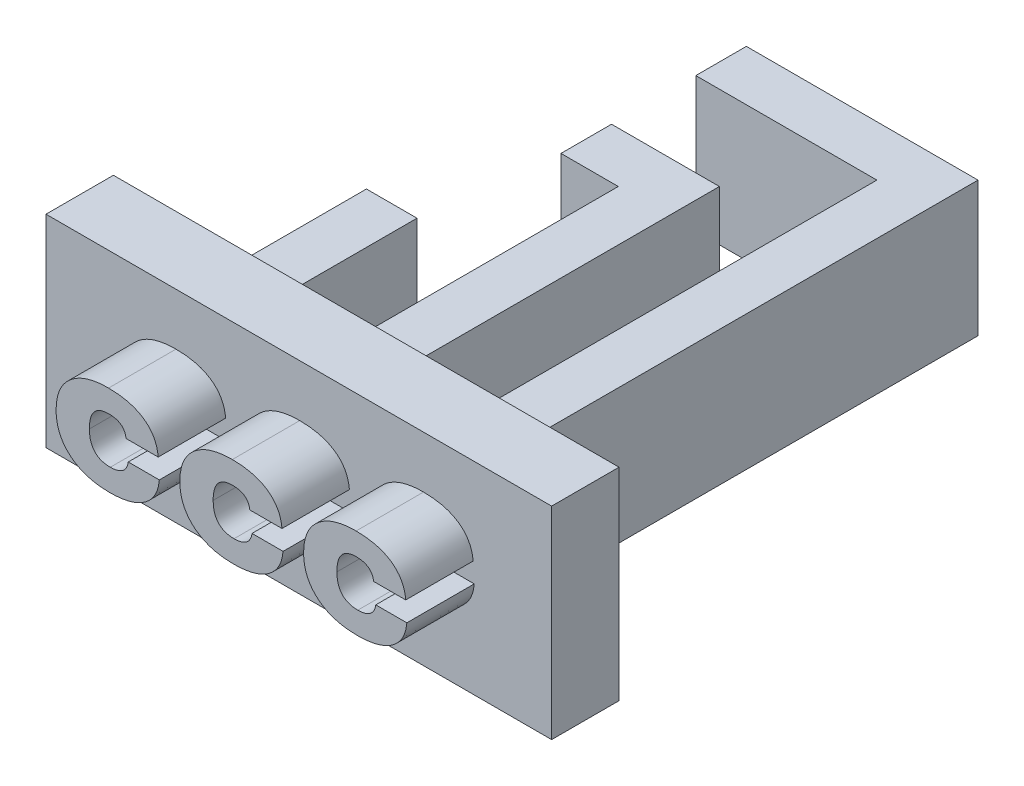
from build123d import *

# Parameters (mm, degrees)
SKETCH1_W           = 15
SKETCH1_H           = 6
BOSS_EXTRUDE1_DEPTH = 2
BOSS_EXTRUDE2_DEPTH = 2
SKETCH3_W           = 1.5
SKETCH3_H           = 4.4
BOSS_EXTRUDE3_DEPTH = 2


with BuildPart() as part:
    # Sketch1 → Boss-Extrude1 (new body)
    with BuildSketch(Plane.XY):
        Rectangle(SKETCH1_W, SKETCH1_H)
    extrude(amount=BOSS_EXTRUDE1_DEPTH)

    # Sketch2 → Boss-Extrude2 (add)
    with BuildSketch(Plane.XY.offset(2)):
        with BuildLine():
            Line((-3.060082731, -0.145888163), (-2.138122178, -0.145888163))
            add(Edge.make_bspline(
                [(-2.138122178, -0.145888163), (-2.142670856, -0.186817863), (-2.151591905, -0.267090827), (-2.177769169, -0.383345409), (-2.21581097, -0.492138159), (-2.263624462, -0.594453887), (-2.323094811, -0.689286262), (-2.393268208, -0.777226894), (-2.474496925, -0.857513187), (-2.56593251, -0.930702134), (-2.666921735, -0.996049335), (-2.776982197, -1.052595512), (-2.895454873, -1.100578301), (-3.022533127, -1.139544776), (-3.158112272, -1.169766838), (-3.302219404, -1.190920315), (-3.454592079, -1.204838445), (-3.559102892, -1.206109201), (-3.612641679, -1.206760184)],
                knots=[0, 0, 0, 0, 0.976829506, 1.915797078, 2.820653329, 3.707285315, 4.590388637, 5.470720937, 6.371504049, 7.295059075, 8.245589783, 9.221265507, 10.22720936, 11.275107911, 12.372107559, 13.52041678, 14.729759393, 16, 16, 16, 16], degree=3))
            add(Edge.make_bspline(
                [(-3.612641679, -1.206760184), (-3.672703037, -1.205681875), (-3.78980194, -1.203579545), (-3.960409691, -1.187028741), (-4.121131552, -1.159524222), (-4.272151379, -1.120467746), (-4.41338954, -1.070117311), (-4.545018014, -1.008999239), (-4.666052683, -0.9357143), (-4.759428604, -0.866298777), (-4.827861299, -0.80519677), (-4.876126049, -0.757629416), (-4.920907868, -0.707879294), (-4.961799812, -0.655502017), (-5.001017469, -0.602324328), (-5.03520084, -0.545835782), (-5.066531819, -0.487757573), (-5.095227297, -0.427867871), (-5.119706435, -0.365492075), (-5.141169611, -0.301230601), (-5.160246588, -0.235142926), (-5.173972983, -0.16652574), (-5.186283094, -0.096102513), (-5.194098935, -0.023574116), (-5.199662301, 0.050901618), (-5.200117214, 0.101226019), (-5.200348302, 0.126789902)],
                knots=[0, 0, 0, 0, 1.844349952, 3.595845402, 5.258382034, 6.847576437, 8.380255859, 9.857610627, 11.296535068, 12.718617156, 13.423703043, 14.112710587, 14.79899505, 15.477617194, 16.152961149, 16.826845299, 17.503194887, 18.179359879, 18.864977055, 19.559518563, 20.259847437, 20.975709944, 21.707382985, 22.454791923, 23.215062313, 24, 24, 24, 24], degree=3))
            add(Edge.make_bspline(
                [(-5.200348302, 0.126789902), (-5.20010237, 0.152180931), (-5.199614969, 0.202502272), (-5.194209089, 0.276824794), (-5.186092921, 0.349110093), (-5.174639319, 0.419303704), (-5.16060764, 0.487612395), (-5.142177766, 0.553751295), (-5.121526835, 0.618038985), (-5.096362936, 0.679989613), (-5.06892589, 0.74011142), (-5.037645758, 0.797974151), (-5.003916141, 0.854253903), (-4.966122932, 0.908133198), (-4.925686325, 0.960385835), (-4.880950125, 1.009688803), (-4.833769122, 1.057627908), (-4.766340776, 1.11879755), (-4.675008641, 1.189066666), (-4.555365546, 1.261581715), (-4.426723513, 1.323905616), (-4.288155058, 1.373282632), (-4.140527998, 1.412584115), (-3.983451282, 1.440688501), (-3.816730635, 1.457118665), (-3.702542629, 1.459248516), (-3.644025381, 1.460339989)],
                knots=[0, 0, 0, 0, 0.788949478, 1.563583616, 2.314590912, 3.048845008, 3.773225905, 4.480463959, 5.181590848, 5.870415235, 6.557195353, 7.234374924, 7.913502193, 8.595071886, 9.278472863, 9.965397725, 10.662604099, 11.368153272, 12.793402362, 14.235777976, 15.708930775, 17.227954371, 18.799982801, 20.451742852, 22.181645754, 24, 24, 24, 24], degree=3))
            add(Edge.make_bspline(
                [(-3.644025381, 1.460339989), (-3.590145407, 1.459654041), (-3.484967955, 1.458315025), (-3.331779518, 1.444898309), (-3.187282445, 1.425014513), (-3.051742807, 1.395613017), (-2.925065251, 1.357757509), (-2.807100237, 1.311399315), (-2.697988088, 1.256802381), (-2.597921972, 1.19407992), (-2.507288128, 1.123496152), (-2.42730916, 1.045048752), (-2.357479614, 0.959432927), (-2.298872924, 0.866301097), (-2.249803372, 0.766268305), (-2.212782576, 0.658660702), (-2.184664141, 0.544165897), (-2.175657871, 0.464783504), (-2.17104934, 0.42416334)],
                knots=[0, 0, 0, 0, 1.289638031, 2.517463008, 3.678757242, 4.779638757, 5.834372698, 6.840786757, 7.810284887, 8.751219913, 9.663723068, 10.555058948, 11.427779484, 12.302574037, 13.183982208, 14.089056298, 15.022165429, 16, 16, 16, 16], degree=3))
            Line((-2.17104934, 0.42416334), (-3.125937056, 0.42416334))
            add(Edge.make_bspline(
                [(-3.125937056, 0.42416334), (-3.127887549, 0.43930189), (-3.131710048, 0.468969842), (-3.142040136, 0.511730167), (-3.155998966, 0.551467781), (-3.173017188, 0.588472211), (-3.193630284, 0.622418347), (-3.217560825, 0.653683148), (-3.244880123, 0.682137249), (-3.275932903, 0.70732909), (-3.310313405, 0.72961548), (-3.347848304, 0.749134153), (-3.388701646, 0.76557697), (-3.432765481, 0.77899212), (-3.480105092, 0.789183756), (-3.530681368, 0.796119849), (-3.584421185, 0.801027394), (-3.621376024, 0.801535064), (-3.640423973, 0.801796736)],
                knots=[0, 0, 0, 0, 1.02792653, 2.014490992, 2.957386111, 3.862121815, 4.753924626, 5.627574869, 6.51019678, 7.405362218, 8.315615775, 9.266619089, 10.251558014, 11.278704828, 12.366648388, 13.51059177, 14.716862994, 16, 16, 16, 16], degree=3))
            add(Edge.make_bspline(
                [(-3.640423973, 0.801796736), (-3.66359615, 0.801322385), (-3.708533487, 0.800402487), (-3.773695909, 0.792761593), (-3.834173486, 0.779391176), (-3.890254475, 0.760839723), (-3.942034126, 0.737056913), (-3.989624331, 0.708404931), (-4.032399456, 0.67383737), (-4.070628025, 0.634091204), (-4.104105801, 0.588767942), (-4.133882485, 0.538692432), (-4.157647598, 0.482571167), (-4.177808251, 0.421494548), (-4.193663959, 0.355071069), (-4.204784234, 0.283334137), (-4.211575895, 0.206324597), (-4.212207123, 0.153214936), (-4.212533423, 0.125760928)],
                knots=[0, 0, 0, 0, 1.096253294, 2.125941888, 3.09853747, 4.02234602, 4.9155674, 5.789561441, 6.643741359, 7.510358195, 8.391630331, 9.304611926, 10.260406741, 11.268901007, 12.345516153, 13.487518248, 14.70122137, 16, 16, 16, 16], degree=3))
            add(Edge.make_bspline(
                [(-4.212533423, 0.125760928), (-4.212023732, 0.098820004), (-4.211034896, 0.046552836), (-4.20387538, -0.029304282), (-4.191745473, -0.100083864), (-4.174082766, -0.165772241), (-4.152269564, -0.226559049), (-4.125261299, -0.282308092), (-4.09338658, -0.333065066), (-4.056054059, -0.378504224), (-4.014296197, -0.419012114), (-3.96742428, -0.453622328), (-3.91626571, -0.483220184), (-3.860158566, -0.506780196), (-3.799647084, -0.525328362), (-3.73468148, -0.538434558), (-3.665177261, -0.547030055), (-3.617299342, -0.547812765), (-3.592576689, -0.548216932)],
                knots=[0, 0, 0, 0, 1.234472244, 2.394957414, 3.488022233, 4.52125041, 5.508253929, 6.443198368, 7.354559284, 8.248126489, 9.131859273, 10.013633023, 10.911406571, 11.833948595, 12.795981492, 13.807064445, 14.867636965, 16, 16, 16, 16], degree=3))
            add(Edge.make_bspline(
                [(-3.592576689, -0.548216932), (-3.573523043, -0.548008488), (-3.53637073, -0.547602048), (-3.482331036, -0.541902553), (-3.431051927, -0.534930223), (-3.383278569, -0.522562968), (-3.338007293, -0.508440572), (-3.295951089, -0.490511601), (-3.256998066, -0.469088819), (-3.220875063, -0.445176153), (-3.188314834, -0.417525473), (-3.158686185, -0.387396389), (-3.133666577, -0.353410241), (-3.111160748, -0.317572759), (-3.093383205, -0.278451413), (-3.078216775, -0.23709906), (-3.066824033, -0.192623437), (-3.06236613, -0.161718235), (-3.060082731, -0.145888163)],
                knots=[0, 0, 0, 0, 1.233312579, 2.404810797, 3.516940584, 4.580999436, 5.596108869, 6.586365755, 7.535726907, 8.472201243, 9.38661427, 10.29778373, 11.201885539, 12.11434029, 13.033597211, 13.978725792, 14.964675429, 16, 16, 16, 16], degree=3))
        make_face()
        with BuildLine():
            Line((0.611295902, -0.145888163), (1.533256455, -0.145888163))
            add(Edge.make_bspline(
                [(1.533256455, -0.145888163), (1.528707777, -0.186817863), (1.519786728, -0.267090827), (1.493609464, -0.383345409), (1.455567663, -0.492138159), (1.407754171, -0.594453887), (1.348283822, -0.689286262), (1.278110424, -0.777226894), (1.196881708, -0.857513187), (1.105446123, -0.930702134), (1.004456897, -0.996049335), (0.894396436, -1.052595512), (0.775923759, -1.100578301), (0.648845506, -1.139544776), (0.51326636, -1.169766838), (0.369159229, -1.190920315), (0.216786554, -1.204838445), (0.112275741, -1.206109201), (0.058736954, -1.206760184)],
                knots=[0, 0, 0, 0, 0.976829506, 1.915797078, 2.820653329, 3.707285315, 4.590388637, 5.470720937, 6.371504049, 7.295059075, 8.245589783, 9.221265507, 10.22720936, 11.275107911, 12.372107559, 13.52041678, 14.729759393, 16, 16, 16, 16], degree=3))
            add(Edge.make_bspline(
                [(0.058736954, -1.206760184), (-0.001324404, -1.205681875), (-0.118423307, -1.203579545), (-0.289031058, -1.187028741), (-0.449752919, -1.159524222), (-0.600772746, -1.120467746), (-0.742010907, -1.070117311), (-0.873639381, -1.008999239), (-0.99467405, -0.9357143), (-1.088049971, -0.866298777), (-1.156482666, -0.80519677), (-1.204747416, -0.757629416), (-1.249529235, -0.707879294), (-1.290421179, -0.655502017), (-1.329638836, -0.602324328), (-1.363822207, -0.545835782), (-1.395153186, -0.487757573), (-1.423848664, -0.427867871), (-1.448327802, -0.365492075), (-1.469790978, -0.301230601), (-1.488867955, -0.235142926), (-1.50259435, -0.16652574), (-1.514904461, -0.096102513), (-1.522720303, -0.023574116), (-1.528283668, 0.050901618), (-1.528738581, 0.101226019), (-1.528969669, 0.126789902)],
                knots=[0, 0, 0, 0, 1.844349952, 3.595845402, 5.258382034, 6.847576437, 8.380255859, 9.857610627, 11.296535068, 12.718617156, 13.423703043, 14.112710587, 14.79899505, 15.477617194, 16.152961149, 16.826845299, 17.503194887, 18.179359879, 18.864977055, 19.559518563, 20.259847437, 20.975709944, 21.707382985, 22.454791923, 23.215062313, 24, 24, 24, 24], degree=3))
            add(Edge.make_bspline(
                [(-1.528969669, 0.126789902), (-1.528723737, 0.152180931), (-1.528236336, 0.202502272), (-1.522830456, 0.276824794), (-1.514714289, 0.349110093), (-1.503260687, 0.419303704), (-1.489229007, 0.487612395), (-1.470799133, 0.553751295), (-1.450148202, 0.618038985), (-1.424984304, 0.679989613), (-1.397547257, 0.74011142), (-1.366267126, 0.797974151), (-1.332537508, 0.854253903), (-1.294744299, 0.908133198), (-1.254307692, 0.960385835), (-1.209571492, 1.009688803), (-1.162390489, 1.057627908), (-1.094962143, 1.11879755), (-1.003630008, 1.189066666), (-0.883986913, 1.261581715), (-0.75534488, 1.323905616), (-0.616776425, 1.373282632), (-0.469149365, 1.412584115), (-0.312072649, 1.440688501), (-0.145352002, 1.457118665), (-0.031163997, 1.459248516), (0.027353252, 1.460339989)],
                knots=[0, 0, 0, 0, 0.788949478, 1.563583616, 2.314590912, 3.048845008, 3.773225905, 4.480463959, 5.181590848, 5.870415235, 6.557195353, 7.234374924, 7.913502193, 8.595071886, 9.278472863, 9.965397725, 10.662604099, 11.368153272, 12.793402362, 14.235777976, 15.708930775, 17.227954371, 18.799982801, 20.451742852, 22.181645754, 24, 24, 24, 24], degree=3))
            add(Edge.make_bspline(
                [(0.027353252, 1.460339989), (0.081233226, 1.459654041), (0.186410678, 1.458315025), (0.339599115, 1.444898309), (0.484096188, 1.425014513), (0.619635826, 1.395613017), (0.746313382, 1.357757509), (0.864278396, 1.311399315), (0.973390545, 1.256802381), (1.073456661, 1.19407992), (1.164090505, 1.123496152), (1.244069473, 1.045048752), (1.313899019, 0.959432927), (1.372505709, 0.866301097), (1.421575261, 0.766268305), (1.458596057, 0.658660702), (1.486714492, 0.544165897), (1.495720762, 0.464783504), (1.500329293, 0.42416334)],
                knots=[0, 0, 0, 0, 1.289638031, 2.517463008, 3.678757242, 4.779638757, 5.834372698, 6.840786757, 7.810284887, 8.751219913, 9.663723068, 10.555058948, 11.427779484, 12.302574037, 13.183982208, 14.089056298, 15.022165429, 16, 16, 16, 16], degree=3))
            Line((1.500329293, 0.42416334), (0.545441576, 0.42416334))
            add(Edge.make_bspline(
                [(0.545441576, 0.42416334), (0.543491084, 0.43930189), (0.539668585, 0.468969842), (0.529338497, 0.511730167), (0.515379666, 0.551467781), (0.498361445, 0.588472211), (0.477748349, 0.622418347), (0.453817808, 0.653683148), (0.42649851, 0.682137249), (0.39544573, 0.70732909), (0.361065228, 0.72961548), (0.323530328, 0.749134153), (0.282676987, 0.76557697), (0.238613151, 0.77899212), (0.191273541, 0.789183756), (0.140697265, 0.796119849), (0.086957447, 0.801027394), (0.050002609, 0.801535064), (0.03095466, 0.801796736)],
                knots=[0, 0, 0, 0, 1.02792653, 2.014490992, 2.957386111, 3.862121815, 4.753924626, 5.627574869, 6.51019678, 7.405362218, 8.315615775, 9.266619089, 10.251558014, 11.278704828, 12.366648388, 13.51059177, 14.716862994, 16, 16, 16, 16], degree=3))
            add(Edge.make_bspline(
                [(0.03095466, 0.801796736), (0.007782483, 0.801322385), (-0.037154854, 0.800402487), (-0.102317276, 0.792761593), (-0.162794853, 0.779391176), (-0.218875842, 0.760839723), (-0.270655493, 0.737056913), (-0.318245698, 0.708404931), (-0.361020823, 0.67383737), (-0.399249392, 0.634091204), (-0.432727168, 0.588767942), (-0.462503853, 0.538692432), (-0.486268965, 0.482571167), (-0.506429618, 0.421494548), (-0.522285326, 0.355071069), (-0.533405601, 0.283334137), (-0.540197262, 0.206324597), (-0.54082849, 0.153214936), (-0.54115479, 0.125760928)],
                knots=[0, 0, 0, 0, 1.096253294, 2.125941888, 3.09853747, 4.02234602, 4.9155674, 5.789561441, 6.643741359, 7.510358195, 8.391630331, 9.304611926, 10.260406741, 11.268901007, 12.345516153, 13.487518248, 14.70122137, 16, 16, 16, 16], degree=3))
            add(Edge.make_bspline(
                [(-0.54115479, 0.125760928), (-0.540645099, 0.098820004), (-0.539656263, 0.046552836), (-0.532496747, -0.029304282), (-0.52036684, -0.100083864), (-0.502704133, -0.165772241), (-0.480890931, -0.226559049), (-0.453882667, -0.282308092), (-0.422007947, -0.333065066), (-0.384675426, -0.378504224), (-0.342917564, -0.419012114), (-0.296045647, -0.453622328), (-0.244887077, -0.483220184), (-0.188779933, -0.506780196), (-0.128268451, -0.525328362), (-0.063302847, -0.538434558), (0.006201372, -0.547030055), (0.054079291, -0.547812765), (0.078801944, -0.548216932)],
                knots=[0, 0, 0, 0, 1.234472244, 2.394957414, 3.488022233, 4.52125041, 5.508253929, 6.443198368, 7.354559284, 8.248126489, 9.131859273, 10.013633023, 10.911406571, 11.833948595, 12.795981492, 13.807064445, 14.867636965, 16, 16, 16, 16], degree=3))
            add(Edge.make_bspline(
                [(0.078801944, -0.548216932), (0.09785559, -0.548008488), (0.135007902, -0.547602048), (0.189047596, -0.541902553), (0.240326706, -0.534930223), (0.288100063, -0.522562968), (0.33337134, -0.508440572), (0.375427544, -0.490511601), (0.414380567, -0.469088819), (0.45050357, -0.445176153), (0.483063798, -0.417525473), (0.512692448, -0.387396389), (0.537712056, -0.353410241), (0.560217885, -0.317572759), (0.577995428, -0.278451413), (0.593161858, -0.23709906), (0.6045546, -0.192623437), (0.609012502, -0.161718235), (0.611295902, -0.145888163)],
                knots=[0, 0, 0, 0, 1.233312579, 2.404810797, 3.516940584, 4.580999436, 5.596108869, 6.586365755, 7.535726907, 8.472201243, 9.38661427, 10.29778373, 11.201885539, 12.11434029, 13.033597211, 13.978725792, 14.964675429, 16, 16, 16, 16], degree=3))
        make_face()
        with BuildLine():
            Line((4.282674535, -0.145888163), (5.204635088, -0.145888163))
            add(Edge.make_bspline(
                [(5.204635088, -0.145888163), (5.20008641, -0.186817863), (5.191165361, -0.267090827), (5.164988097, -0.383345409), (5.126946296, -0.492138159), (5.079132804, -0.594453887), (5.019662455, -0.689286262), (4.949489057, -0.777226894), (4.868260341, -0.857513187), (4.776824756, -0.930702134), (4.67583553, -0.996049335), (4.565775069, -1.052595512), (4.447302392, -1.100578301), (4.320224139, -1.139544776), (4.184644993, -1.169766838), (4.040537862, -1.190920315), (3.888165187, -1.204838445), (3.783654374, -1.206109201), (3.730115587, -1.206760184)],
                knots=[0, 0, 0, 0, 0.976829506, 1.915797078, 2.820653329, 3.707285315, 4.590388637, 5.470720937, 6.371504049, 7.295059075, 8.245589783, 9.221265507, 10.22720936, 11.275107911, 12.372107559, 13.52041678, 14.729759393, 16, 16, 16, 16], degree=3))
            add(Edge.make_bspline(
                [(3.730115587, -1.206760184), (3.670054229, -1.205681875), (3.552955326, -1.203579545), (3.382347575, -1.187028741), (3.221625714, -1.159524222), (3.070605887, -1.120467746), (2.929367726, -1.070117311), (2.797739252, -1.008999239), (2.676704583, -0.9357143), (2.583328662, -0.866298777), (2.514895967, -0.80519677), (2.466631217, -0.757629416), (2.421849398, -0.707879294), (2.380957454, -0.655502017), (2.341739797, -0.602324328), (2.307556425, -0.545835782), (2.276225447, -0.487757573), (2.247529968, -0.427867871), (2.223050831, -0.365492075), (2.201587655, -0.301230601), (2.182510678, -0.235142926), (2.168784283, -0.16652574), (2.156474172, -0.096102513), (2.14865833, -0.023574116), (2.143094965, 0.050901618), (2.142640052, 0.101226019), (2.142408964, 0.126789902)],
                knots=[0, 0, 0, 0, 1.844349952, 3.595845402, 5.258382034, 6.847576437, 8.380255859, 9.857610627, 11.296535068, 12.718617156, 13.423703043, 14.112710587, 14.79899505, 15.477617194, 16.152961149, 16.826845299, 17.503194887, 18.179359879, 18.864977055, 19.559518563, 20.259847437, 20.975709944, 21.707382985, 22.454791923, 23.215062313, 24, 24, 24, 24], degree=3))
            add(Edge.make_bspline(
                [(2.142408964, 0.126789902), (2.142654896, 0.152180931), (2.143142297, 0.202502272), (2.148548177, 0.276824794), (2.156664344, 0.349110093), (2.168117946, 0.419303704), (2.182149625, 0.487612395), (2.2005795, 0.553751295), (2.221230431, 0.618038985), (2.246394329, 0.679989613), (2.273831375, 0.74011142), (2.305111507, 0.797974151), (2.338841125, 0.854253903), (2.376634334, 0.908133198), (2.417070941, 0.960385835), (2.461807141, 1.009688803), (2.508988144, 1.057627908), (2.57641649, 1.11879755), (2.667748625, 1.189066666), (2.78739172, 1.261581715), (2.916033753, 1.323905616), (3.054602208, 1.373282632), (3.202229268, 1.412584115), (3.359305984, 1.440688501), (3.52602663, 1.457118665), (3.640214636, 1.459248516), (3.698731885, 1.460339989)],
                knots=[0, 0, 0, 0, 0.788949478, 1.563583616, 2.314590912, 3.048845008, 3.773225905, 4.480463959, 5.181590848, 5.870415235, 6.557195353, 7.234374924, 7.913502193, 8.595071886, 9.278472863, 9.965397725, 10.662604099, 11.368153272, 12.793402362, 14.235777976, 15.708930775, 17.227954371, 18.799982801, 20.451742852, 22.181645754, 24, 24, 24, 24], degree=3))
            add(Edge.make_bspline(
                [(3.698731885, 1.460339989), (3.752611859, 1.459654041), (3.857789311, 1.458315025), (4.010977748, 1.444898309), (4.155474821, 1.425014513), (4.291014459, 1.395613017), (4.417692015, 1.357757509), (4.535657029, 1.311399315), (4.644769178, 1.256802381), (4.744835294, 1.19407992), (4.835469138, 1.123496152), (4.915448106, 1.045048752), (4.985277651, 0.959432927), (5.043884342, 0.866301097), (5.092953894, 0.766268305), (5.12997469, 0.658660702), (5.158093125, 0.544165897), (5.167099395, 0.464783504), (5.171707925, 0.42416334)],
                knots=[0, 0, 0, 0, 1.289638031, 2.517463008, 3.678757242, 4.779638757, 5.834372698, 6.840786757, 7.810284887, 8.751219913, 9.663723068, 10.555058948, 11.427779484, 12.302574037, 13.183982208, 14.089056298, 15.022165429, 16, 16, 16, 16], degree=3))
            Line((5.171707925, 0.42416334), (4.216820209, 0.42416334))
            add(Edge.make_bspline(
                [(4.216820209, 0.42416334), (4.214869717, 0.43930189), (4.211047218, 0.468969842), (4.20071713, 0.511730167), (4.186758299, 0.551467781), (4.169740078, 0.588472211), (4.149126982, 0.622418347), (4.125196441, 0.653683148), (4.097877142, 0.682137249), (4.066824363, 0.70732909), (4.032443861, 0.72961548), (3.994908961, 0.749134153), (3.95405562, 0.76557697), (3.909991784, 0.77899212), (3.862652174, 0.789183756), (3.812075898, 0.796119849), (3.75833608, 0.801027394), (3.721381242, 0.801535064), (3.702333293, 0.801796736)],
                knots=[0, 0, 0, 0, 1.02792653, 2.014490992, 2.957386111, 3.862121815, 4.753924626, 5.627574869, 6.51019678, 7.405362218, 8.315615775, 9.266619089, 10.251558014, 11.278704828, 12.366648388, 13.51059177, 14.716862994, 16, 16, 16, 16], degree=3))
            add(Edge.make_bspline(
                [(3.702333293, 0.801796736), (3.679161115, 0.801322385), (3.634223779, 0.800402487), (3.569061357, 0.792761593), (3.50858378, 0.779391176), (3.452502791, 0.760839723), (3.400723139, 0.737056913), (3.353132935, 0.708404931), (3.31035781, 0.67383737), (3.272129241, 0.634091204), (3.238651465, 0.588767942), (3.20887478, 0.538692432), (3.185109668, 0.482571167), (3.164949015, 0.421494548), (3.149093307, 0.355071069), (3.137973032, 0.283334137), (3.13118137, 0.206324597), (3.130550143, 0.153214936), (3.130223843, 0.125760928)],
                knots=[0, 0, 0, 0, 1.096253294, 2.125941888, 3.09853747, 4.02234602, 4.9155674, 5.789561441, 6.643741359, 7.510358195, 8.391630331, 9.304611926, 10.260406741, 11.268901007, 12.345516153, 13.487518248, 14.70122137, 16, 16, 16, 16], degree=3))
            add(Edge.make_bspline(
                [(3.130223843, 0.125760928), (3.130733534, 0.098820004), (3.131722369, 0.046552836), (3.138881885, -0.029304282), (3.151011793, -0.100083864), (3.1686745, -0.165772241), (3.190487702, -0.226559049), (3.217495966, -0.282308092), (3.249370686, -0.333065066), (3.286703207, -0.378504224), (3.328461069, -0.419012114), (3.375332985, -0.453622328), (3.426491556, -0.483220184), (3.4825987, -0.506780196), (3.543110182, -0.525328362), (3.608075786, -0.538434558), (3.677580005, -0.547030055), (3.725457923, -0.547812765), (3.750180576, -0.548216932)],
                knots=[0, 0, 0, 0, 1.234472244, 2.394957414, 3.488022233, 4.52125041, 5.508253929, 6.443198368, 7.354559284, 8.248126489, 9.131859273, 10.013633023, 10.911406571, 11.833948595, 12.795981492, 13.807064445, 14.867636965, 16, 16, 16, 16], degree=3))
            add(Edge.make_bspline(
                [(3.750180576, -0.548216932), (3.769234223, -0.548008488), (3.806386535, -0.547602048), (3.860426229, -0.541902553), (3.911705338, -0.534930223), (3.959478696, -0.522562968), (4.004749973, -0.508440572), (4.046806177, -0.490511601), (4.0857592, -0.469088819), (4.121882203, -0.445176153), (4.154442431, -0.417525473), (4.184071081, -0.387396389), (4.209090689, -0.353410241), (4.231596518, -0.317572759), (4.249374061, -0.278451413), (4.264540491, -0.23709906), (4.275933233, -0.192623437), (4.280391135, -0.161718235), (4.282674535, -0.145888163)],
                knots=[0, 0, 0, 0, 1.233312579, 2.404810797, 3.516940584, 4.580999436, 5.596108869, 6.586365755, 7.535726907, 8.472201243, 9.38661427, 10.29778373, 11.201885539, 12.11434029, 13.033597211, 13.978725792, 14.964675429, 16, 16, 16, 16], degree=3))
        make_face()
    extrude(amount=BOSS_EXTRUDE2_DEPTH)

    # Sketch3 → Boss-Extrude3 (add, symmetric)
    with BuildSketch(Plane(origin=(0, 0, 0), x_dir=(1, 0, 0), z_dir=(0, 1, 0))):
        Polygon((2.948731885, 0), (4.448731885, 0), (4.448731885, 13.7), (-2.422646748, 13.7), (-2.422646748, 12.2), (2.948731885, 12.2), align=None)
        with Locations((-3.644025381, 2.2)):
            Rectangle(SKETCH3_W, SKETCH3_H)
        Polygon((-0.722646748, 0), (0.777353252, 0), (0.777353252, 9.7), (-2.422646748, 9.7), (-2.422646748, 8.2), (-0.722646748, 8.2), align=None)
    extrude(amount=BOSS_EXTRUDE3_DEPTH, both=True)


solid = part.part
